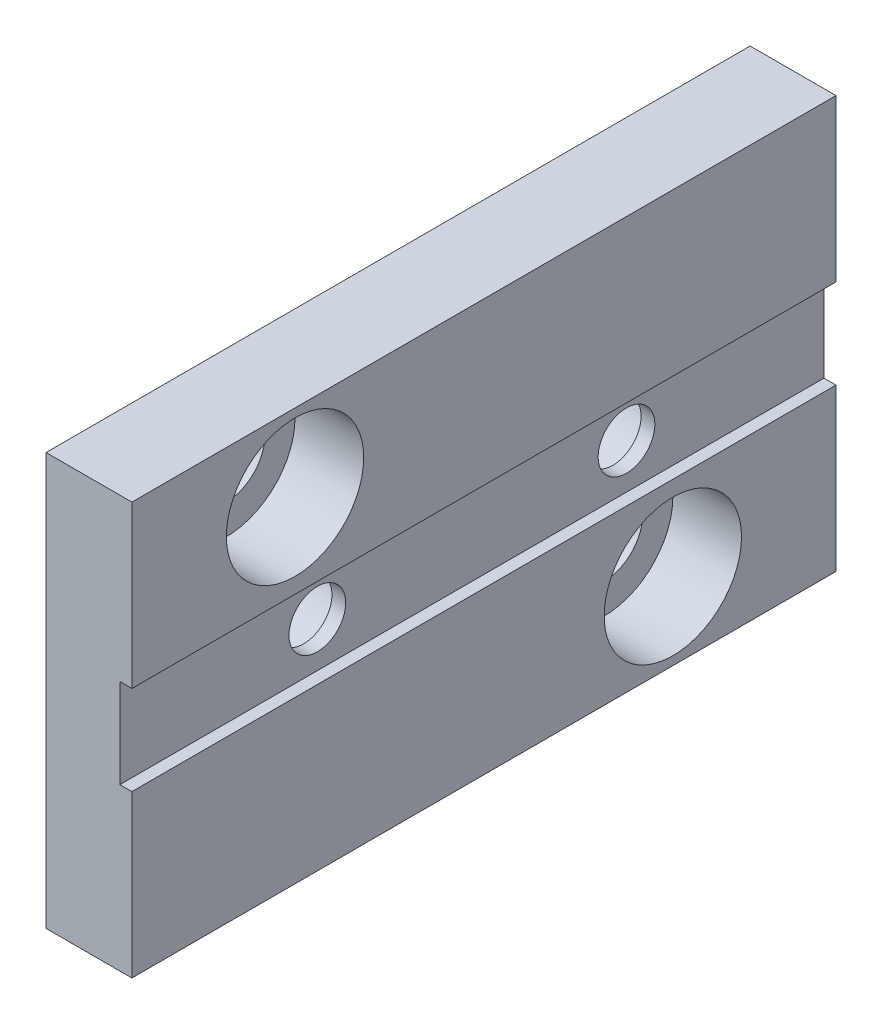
ISO-10303-21;
HEADER;
FILE_DESCRIPTION(('STEP AP214'),'2;1');
FILE_NAME('part.step','',(''),(''),'','','');
FILE_SCHEMA(('AUTOMOTIVE_DESIGN { 1 0 10303 214 1 1 1 1 }'));
ENDSEC;
DATA;
#1=APPLICATION_CONTEXT('core data for automotive mechanical design processes');
#2=APPLICATION_PROTOCOL_DEFINITION('international standard','automotive_design',2000,#1);
#3=PRODUCT_CONTEXT('',#1,'mechanical');
#4=PRODUCT('Part','Part','',(#3));
#5=PRODUCT_RELATED_PRODUCT_CATEGORY('part','',(#4));
#6=PRODUCT_DEFINITION_FORMATION('','',#4);
#7=PRODUCT_DEFINITION_CONTEXT('part definition',#1,'design');
#8=PRODUCT_DEFINITION('design','',#6,#7);
#9=PRODUCT_DEFINITION_SHAPE('','',#8);
#10=(LENGTH_UNIT() NAMED_UNIT(*) SI_UNIT(.MILLI.,.METRE.));
#11=(NAMED_UNIT(*) PLANE_ANGLE_UNIT() SI_UNIT($,.RADIAN.));
#12=(NAMED_UNIT(*) SI_UNIT($,.STERADIAN.) SOLID_ANGLE_UNIT());
#13=UNCERTAINTY_MEASURE_WITH_UNIT(LENGTH_MEASURE(1.E-05),#10,'distance_accuracy_value','');
#14=(GEOMETRIC_REPRESENTATION_CONTEXT(3) GLOBAL_UNCERTAINTY_ASSIGNED_CONTEXT((#13)) GLOBAL_UNIT_ASSIGNED_CONTEXT((#10,
#11,#12)) REPRESENTATION_CONTEXT('',''));
#15=CARTESIAN_POINT('',(0.,0.,0.));
#16=DIRECTION('',(0.,0.,1.));
#17=DIRECTION('',(1.,0.,0.));
#18=AXIS2_PLACEMENT_3D('',#15,#16,#17);
#19=CARTESIAN_POINT('',(1.,0.5,-11.));
#20=DIRECTION('',(1.,0.,0.));
#21=DIRECTION('',(0.,0.,-1.));
#22=AXIS2_PLACEMENT_3D('',#19,#20,#21);
#23=CYLINDRICAL_SURFACE('',#22,4.);
#24=CARTESIAN_POINT('',(5.,0.5,-11.));
#25=DIRECTION('',(1.,0.,0.));
#26=DIRECTION('',(0.,0.,-1.));
#27=AXIS2_PLACEMENT_3D('',#24,#25,#26);
#28=CIRCLE('',#27,4.);
#29=CARTESIAN_POINT('',(5.,0.5,-15.));
#30=VERTEX_POINT('',#29);
#31=EDGE_CURVE('E126',#30,#30,#28,.F.);
#32=ORIENTED_EDGE('',*,*,#31,.F.);
#33=EDGE_LOOP('',(#32));
#34=FACE_BOUND('',#33,.T.);
#35=CARTESIAN_POINT('',(1.,0.5,-11.));
#36=DIRECTION('',(1.,0.,0.));
#37=DIRECTION('',(0.,0.,-1.));
#38=AXIS2_PLACEMENT_3D('',#35,#36,#37);
#39=CIRCLE('',#38,4.);
#40=CARTESIAN_POINT('',(1.,0.5,-15.));
#41=VERTEX_POINT('',#40);
#42=EDGE_CURVE('E20',#41,#41,#39,.T.);
#43=ORIENTED_EDGE('',*,*,#42,.F.);
#44=EDGE_LOOP('',(#43));
#45=FACE_BOUND('',#44,.T.);
#46=ADVANCED_FACE('F17',(#34,#45),#23,.F.);
#47=CARTESIAN_POINT('',(4.3,8.,9.));
#48=DIRECTION('',(-1.,0.,0.));
#49=DIRECTION('',(0.,0.,1.));
#50=AXIS2_PLACEMENT_3D('',#47,#48,#49);
#51=CYLINDRICAL_SURFACE('',#50,1.65);
#52=CARTESIAN_POINT('',(4.3,8.,9.));
#53=DIRECTION('',(-1.,0.,0.));
#54=DIRECTION('',(0.,0.,1.));
#55=AXIS2_PLACEMENT_3D('',#52,#53,#54);
#56=CIRCLE('',#55,1.65);
#57=CARTESIAN_POINT('',(4.3,8.,10.65));
#58=VERTEX_POINT('',#57);
#59=EDGE_CURVE('E122',#58,#58,#56,.F.);
#60=ORIENTED_EDGE('',*,*,#59,.T.);
#61=EDGE_LOOP('',(#60));
#62=FACE_BOUND('',#61,.T.);
#63=CARTESIAN_POINT('',(3.5,8.,9.));
#64=DIRECTION('',(-1.,0.,0.));
#65=DIRECTION('',(0.,0.,1.));
#66=AXIS2_PLACEMENT_3D('',#63,#64,#65);
#67=CIRCLE('',#66,1.65);
#68=CARTESIAN_POINT('',(3.5,8.,10.65));
#69=VERTEX_POINT('',#68);
#70=EDGE_CURVE('E159',#69,#69,#67,.F.);
#71=ORIENTED_EDGE('',*,*,#70,.F.);
#72=EDGE_LOOP('',(#71));
#73=FACE_BOUND('',#72,.T.);
#74=ADVANCED_FACE('F174',(#62,#73),#51,.F.);
#75=CARTESIAN_POINT('',(4.3,5.4,-42.));
#76=DIRECTION('',(0.,-1.,0.));
#77=DIRECTION('',(0.,0.,-1.));
#78=AXIS2_PLACEMENT_3D('',#75,#76,#77);
#79=PLANE('',#78);
#80=DIRECTION('',(1.,0.,0.));
#81=VECTOR('',#80,1.);
#82=CARTESIAN_POINT('',(4.3,5.4,-20.5));
#83=LINE('',#82,#81);
#84=CARTESIAN_POINT('',(4.3,5.4,-20.5));
#85=VERTEX_POINT('',#84);
#86=CARTESIAN_POINT('',(5.,5.4,-20.5));
#87=VERTEX_POINT('',#86);
#88=EDGE_CURVE('E92',#85,#87,#83,.T.);
#89=ORIENTED_EDGE('',*,*,#88,.F.);
#90=DIRECTION('',(0.,0.,1.));
#91=VECTOR('',#90,1.);
#92=CARTESIAN_POINT('',(4.3,5.4,-42.));
#93=LINE('',#92,#91);
#94=CARTESIAN_POINT('',(4.3,5.4,20.5));
#95=VERTEX_POINT('',#94);
#96=EDGE_CURVE('E116',#85,#95,#93,.T.);
#97=ORIENTED_EDGE('',*,*,#96,.T.);
#98=DIRECTION('',(1.,0.,0.));
#99=VECTOR('',#98,1.);
#100=CARTESIAN_POINT('',(4.3,5.4,20.5));
#101=LINE('',#100,#99);
#102=CARTESIAN_POINT('',(5.,5.4,20.5));
#103=VERTEX_POINT('',#102);
#104=EDGE_CURVE('E129',#103,#95,#101,.F.);
#105=ORIENTED_EDGE('',*,*,#104,.F.);
#106=DIRECTION('',(0.,0.,-1.));
#107=VECTOR('',#106,1.);
#108=CARTESIAN_POINT('',(5.,5.4,0.));
#109=LINE('',#108,#107);
#110=EDGE_CURVE('E123',#87,#103,#109,.F.);
#111=ORIENTED_EDGE('',*,*,#110,.F.);
#112=EDGE_LOOP('',(#89,#97,#105,#111));
#113=FACE_BOUND('',#112,.T.);
#114=ADVANCED_FACE('F180',(#113),#79,.F.);
#115=CARTESIAN_POINT('',(4.3,8.,-9.));
#116=DIRECTION('',(-1.,0.,0.));
#117=DIRECTION('',(0.,0.,1.));
#118=AXIS2_PLACEMENT_3D('',#115,#116,#117);
#119=CYLINDRICAL_SURFACE('',#118,1.65);
#120=CARTESIAN_POINT('',(4.3,8.,-9.));
#121=DIRECTION('',(-1.,0.,0.));
#122=DIRECTION('',(0.,0.,1.));
#123=AXIS2_PLACEMENT_3D('',#120,#121,#122);
#124=CIRCLE('',#123,1.65);
#125=CARTESIAN_POINT('',(4.3,8.,-7.35));
#126=VERTEX_POINT('',#125);
#127=EDGE_CURVE('E119',#126,#126,#124,.F.);
#128=ORIENTED_EDGE('',*,*,#127,.T.);
#129=EDGE_LOOP('',(#128));
#130=FACE_BOUND('',#129,.T.);
#131=CARTESIAN_POINT('',(3.5,8.,-9.));
#132=DIRECTION('',(-1.,0.,0.));
#133=DIRECTION('',(0.,0.,1.));
#134=AXIS2_PLACEMENT_3D('',#131,#132,#133);
#135=CIRCLE('',#134,1.65);
#136=CARTESIAN_POINT('',(3.5,8.,-7.35));
#137=VERTEX_POINT('',#136);
#138=EDGE_CURVE('E162',#137,#137,#135,.F.);
#139=ORIENTED_EDGE('',*,*,#138,.F.);
#140=EDGE_LOOP('',(#139));
#141=FACE_BOUND('',#140,.T.);
#142=ADVANCED_FACE('F251',(#130,#141),#119,.F.);
#143=CARTESIAN_POINT('',(1.,15.5,11.));
#144=DIRECTION('',(1.,0.,0.));
#145=DIRECTION('',(0.,0.,-1.));
#146=AXIS2_PLACEMENT_3D('',#143,#144,#145);
#147=CYLINDRICAL_SURFACE('',#146,4.);
#148=CARTESIAN_POINT('',(5.,15.5,11.));
#149=DIRECTION('',(1.,0.,0.));
#150=DIRECTION('',(0.,0.,-1.));
#151=AXIS2_PLACEMENT_3D('',#148,#149,#150);
#152=CIRCLE('',#151,4.);
#153=CARTESIAN_POINT('',(5.,15.5,7.));
#154=VERTEX_POINT('',#153);
#155=EDGE_CURVE('E101',#154,#154,#152,.F.);
#156=ORIENTED_EDGE('',*,*,#155,.F.);
#157=EDGE_LOOP('',(#156));
#158=FACE_BOUND('',#157,.T.);
#159=CARTESIAN_POINT('',(1.,15.5,11.));
#160=DIRECTION('',(1.,0.,0.));
#161=DIRECTION('',(0.,0.,-1.));
#162=AXIS2_PLACEMENT_3D('',#159,#160,#161);
#163=CIRCLE('',#162,4.);
#164=CARTESIAN_POINT('',(1.,15.5,7.));
#165=VERTEX_POINT('',#164);
#166=EDGE_CURVE('E164',#165,#165,#163,.T.);
#167=ORIENTED_EDGE('',*,*,#166,.F.);
#168=EDGE_LOOP('',(#167));
#169=FACE_BOUND('',#168,.T.);
#170=ADVANCED_FACE('F248',(#158,#169),#147,.F.);
#171=CARTESIAN_POINT('',(14.7,10.6,-42.));
#172=DIRECTION('',(0.,1.,0.));
#173=DIRECTION('',(0.,0.,1.));
#174=AXIS2_PLACEMENT_3D('',#171,#172,#173);
#175=PLANE('',#174);
#176=DIRECTION('',(1.,0.,0.));
#177=VECTOR('',#176,1.);
#178=CARTESIAN_POINT('',(14.7,10.6,-20.5));
#179=LINE('',#178,#177);
#180=CARTESIAN_POINT('',(5.,10.6,-20.5));
#181=VERTEX_POINT('',#180);
#182=CARTESIAN_POINT('',(4.3,10.6,-20.5));
#183=VERTEX_POINT('',#182);
#184=EDGE_CURVE('E91',#181,#183,#179,.F.);
#185=ORIENTED_EDGE('',*,*,#184,.F.);
#186=DIRECTION('',(0.,0.,-1.));
#187=VECTOR('',#186,1.);
#188=CARTESIAN_POINT('',(5.,10.6,0.));
#189=LINE('',#188,#187);
#190=CARTESIAN_POINT('',(5.,10.6,20.5));
#191=VERTEX_POINT('',#190);
#192=EDGE_CURVE('E95',#191,#181,#189,.T.);
#193=ORIENTED_EDGE('',*,*,#192,.F.);
#194=DIRECTION('',(1.,0.,0.));
#195=VECTOR('',#194,1.);
#196=CARTESIAN_POINT('',(14.7,10.6,20.5));
#197=LINE('',#196,#195);
#198=CARTESIAN_POINT('',(4.3,10.6,20.5));
#199=VERTEX_POINT('',#198);
#200=EDGE_CURVE('E79',#199,#191,#197,.T.);
#201=ORIENTED_EDGE('',*,*,#200,.F.);
#202=DIRECTION('',(0.,0.,1.));
#203=VECTOR('',#202,1.);
#204=CARTESIAN_POINT('',(4.3,10.6,-42.));
#205=LINE('',#204,#203);
#206=EDGE_CURVE('E120',#199,#183,#205,.F.);
#207=ORIENTED_EDGE('',*,*,#206,.T.);
#208=EDGE_LOOP('',(#185,#193,#201,#207));
#209=FACE_BOUND('',#208,.T.);
#210=ADVANCED_FACE('F96',(#209),#175,.F.);
#211=CARTESIAN_POINT('',(1.,0.5,-11.));
#212=DIRECTION('',(1.,0.,0.));
#213=DIRECTION('',(0.,0.,-1.));
#214=AXIS2_PLACEMENT_3D('',#211,#212,#213);
#215=PLANE('',#214);
#216=CARTESIAN_POINT('',(1.,0.5,-11.));
#217=DIRECTION('',(1.,0.,0.));
#218=DIRECTION('',(0.,0.,-1.));
#219=AXIS2_PLACEMENT_3D('',#216,#217,#218);
#220=CIRCLE('',#219,2.25);
#221=CARTESIAN_POINT('',(1.,0.5,-13.25));
#222=VERTEX_POINT('',#221);
#223=EDGE_CURVE('E100',#222,#222,#220,.F.);
#224=ORIENTED_EDGE('',*,*,#223,.T.);
#225=EDGE_LOOP('',(#224));
#226=FACE_BOUND('',#225,.T.);
#227=ORIENTED_EDGE('',*,*,#42,.T.);
#228=EDGE_LOOP('',(#227));
#229=FACE_BOUND('',#228,.T.);
#230=ADVANCED_FACE('F171',(#226,#229),#215,.T.);
#231=CARTESIAN_POINT('',(1.,15.5,11.));
#232=DIRECTION('',(1.,0.,0.));
#233=DIRECTION('',(0.,0.,-1.));
#234=AXIS2_PLACEMENT_3D('',#231,#232,#233);
#235=PLANE('',#234);
#236=CARTESIAN_POINT('',(1.,15.5,11.));
#237=DIRECTION('',(1.,0.,0.));
#238=DIRECTION('',(0.,0.,-1.));
#239=AXIS2_PLACEMENT_3D('',#236,#237,#238);
#240=CIRCLE('',#239,2.25);
#241=CARTESIAN_POINT('',(1.,15.5,8.75));
#242=VERTEX_POINT('',#241);
#243=EDGE_CURVE('E146',#242,#242,#240,.F.);
#244=ORIENTED_EDGE('',*,*,#243,.T.);
#245=EDGE_LOOP('',(#244));
#246=FACE_BOUND('',#245,.T.);
#247=ORIENTED_EDGE('',*,*,#166,.T.);
#248=EDGE_LOOP('',(#247));
#249=FACE_BOUND('',#248,.T.);
#250=ADVANCED_FACE('F238',(#246,#249),#235,.T.);
#251=CARTESIAN_POINT('',(3.5,11.1,-9.));
#252=DIRECTION('',(-1.,0.,0.));
#253=DIRECTION('',(0.,0.,1.));
#254=AXIS2_PLACEMENT_3D('',#251,#252,#253);
#255=PLANE('',#254);
#256=ORIENTED_EDGE('',*,*,#138,.T.);
#257=EDGE_LOOP('',(#256));
#258=FACE_BOUND('',#257,.T.);
#259=CARTESIAN_POINT('',(3.5,8.,-9.));
#260=DIRECTION('',(-1.,0.,0.));
#261=DIRECTION('',(0.,0.,1.));
#262=AXIS2_PLACEMENT_3D('',#259,#260,#261);
#263=CIRCLE('',#262,3.1);
#264=CARTESIAN_POINT('',(3.5,8.,-5.9));
#265=VERTEX_POINT('',#264);
#266=EDGE_CURVE('E112',#265,#265,#263,.T.);
#267=ORIENTED_EDGE('',*,*,#266,.T.);
#268=EDGE_LOOP('',(#267));
#269=FACE_BOUND('',#268,.T.);
#270=ADVANCED_FACE('F234',(#258,#269),#255,.T.);
#271=CARTESIAN_POINT('',(3.5,11.1,9.));
#272=DIRECTION('',(-1.,0.,0.));
#273=DIRECTION('',(0.,0.,1.));
#274=AXIS2_PLACEMENT_3D('',#271,#272,#273);
#275=PLANE('',#274);
#276=ORIENTED_EDGE('',*,*,#70,.T.);
#277=EDGE_LOOP('',(#276));
#278=FACE_BOUND('',#277,.T.);
#279=CARTESIAN_POINT('',(3.5,8.,9.));
#280=DIRECTION('',(-1.,0.,0.));
#281=DIRECTION('',(0.,0.,1.));
#282=AXIS2_PLACEMENT_3D('',#279,#280,#281);
#283=CIRCLE('',#282,3.1);
#284=CARTESIAN_POINT('',(3.5,8.,12.1));
#285=VERTEX_POINT('',#284);
#286=EDGE_CURVE('E107',#285,#285,#283,.T.);
#287=ORIENTED_EDGE('',*,*,#286,.T.);
#288=EDGE_LOOP('',(#287));
#289=FACE_BOUND('',#288,.T.);
#290=ADVANCED_FACE('F230',(#278,#289),#275,.T.);
#291=CARTESIAN_POINT('',(5.,0.,0.));
#292=DIRECTION('',(1.,0.,0.));
#293=DIRECTION('',(0.,0.,-1.));
#294=AXIS2_PLACEMENT_3D('',#291,#292,#293);
#295=PLANE('',#294);
#296=DIRECTION('',(0.,0.,-1.));
#297=VECTOR('',#296,1.);
#298=CARTESIAN_POINT('',(5.,-4.,20.5));
#299=LINE('',#298,#297);
#300=CARTESIAN_POINT('',(5.,-4.,-20.5));
#301=VERTEX_POINT('',#300);
#302=CARTESIAN_POINT('',(5.,-4.,20.5));
#303=VERTEX_POINT('',#302);
#304=EDGE_CURVE('E283',#301,#303,#299,.F.);
#305=ORIENTED_EDGE('',*,*,#304,.F.);
#306=DIRECTION('',(0.,-1.,0.));
#307=VECTOR('',#306,1.);
#308=CARTESIAN_POINT('',(5.,0.2,-20.5));
#309=LINE('',#308,#307);
#310=EDGE_CURVE('E270',#301,#87,#309,.F.);
#311=ORIENTED_EDGE('',*,*,#310,.T.);
#312=ORIENTED_EDGE('',*,*,#110,.T.);
#313=DIRECTION('',(0.,1.,0.));
#314=VECTOR('',#313,1.);
#315=CARTESIAN_POINT('',(5.,15.8,20.5));
#316=LINE('',#315,#314);
#317=EDGE_CURVE('E109',#103,#303,#316,.F.);
#318=ORIENTED_EDGE('',*,*,#317,.T.);
#319=EDGE_LOOP('',(#305,#311,#312,#318));
#320=FACE_BOUND('',#319,.T.);
#321=ORIENTED_EDGE('',*,*,#31,.T.);
#322=EDGE_LOOP('',(#321));
#323=FACE_BOUND('',#322,.T.);
#324=ADVANCED_FACE('F226',(#320,#323),#295,.T.);
#325=CARTESIAN_POINT('',(4.3,10.6,-42.));
#326=DIRECTION('',(-1.,0.,0.));
#327=DIRECTION('',(0.,-1.,0.));
#328=AXIS2_PLACEMENT_3D('',#325,#326,#327);
#329=PLANE('',#328);
#330=ORIENTED_EDGE('',*,*,#127,.F.);
#331=EDGE_LOOP('',(#330));
#332=FACE_BOUND('',#331,.T.);
#333=DIRECTION('',(0.,-1.,0.));
#334=VECTOR('',#333,1.);
#335=CARTESIAN_POINT('',(4.3,0.2,-20.5));
#336=LINE('',#335,#334);
#337=EDGE_CURVE('E268',#85,#183,#336,.F.);
#338=ORIENTED_EDGE('',*,*,#337,.T.);
#339=ORIENTED_EDGE('',*,*,#206,.F.);
#340=DIRECTION('',(0.,1.,0.));
#341=VECTOR('',#340,1.);
#342=CARTESIAN_POINT('',(4.3,15.8,20.5));
#343=LINE('',#342,#341);
#344=EDGE_CURVE('E90',#199,#95,#343,.F.);
#345=ORIENTED_EDGE('',*,*,#344,.T.);
#346=ORIENTED_EDGE('',*,*,#96,.F.);
#347=EDGE_LOOP('',(#338,#339,#345,#346));
#348=FACE_BOUND('',#347,.T.);
#349=ORIENTED_EDGE('',*,*,#59,.F.);
#350=EDGE_LOOP('',(#349));
#351=FACE_BOUND('',#350,.T.);
#352=ADVANCED_FACE('F223',(#332,#348,#351),#329,.F.);
#353=CARTESIAN_POINT('',(5.,0.,0.));
#354=DIRECTION('',(1.,0.,0.));
#355=DIRECTION('',(0.,0.,-1.));
#356=AXIS2_PLACEMENT_3D('',#353,#354,#355);
#357=PLANE('',#356);
#358=ORIENTED_EDGE('',*,*,#192,.T.);
#359=DIRECTION('',(0.,-1.,0.));
#360=VECTOR('',#359,1.);
#361=CARTESIAN_POINT('',(5.,0.2,-20.5));
#362=LINE('',#361,#360);
#363=CARTESIAN_POINT('',(5.,20.,-20.5));
#364=VERTEX_POINT('',#363);
#365=EDGE_CURVE('E279',#181,#364,#362,.F.);
#366=ORIENTED_EDGE('',*,*,#365,.T.);
#367=DIRECTION('',(0.,0.,1.));
#368=VECTOR('',#367,1.);
#369=CARTESIAN_POINT('',(5.,20.,20.5));
#370=LINE('',#369,#368);
#371=CARTESIAN_POINT('',(5.,20.,20.5));
#372=VERTEX_POINT('',#371);
#373=EDGE_CURVE('E106',#372,#364,#370,.F.);
#374=ORIENTED_EDGE('',*,*,#373,.F.);
#375=DIRECTION('',(0.,1.,0.));
#376=VECTOR('',#375,1.);
#377=CARTESIAN_POINT('',(5.,15.8,20.5));
#378=LINE('',#377,#376);
#379=EDGE_CURVE('E87',#372,#191,#378,.F.);
#380=ORIENTED_EDGE('',*,*,#379,.T.);
#381=EDGE_LOOP('',(#358,#366,#374,#380));
#382=FACE_BOUND('',#381,.T.);
#383=ORIENTED_EDGE('',*,*,#155,.T.);
#384=EDGE_LOOP('',(#383));
#385=FACE_BOUND('',#384,.T.);
#386=ADVANCED_FACE('F104',(#382,#385),#357,.T.);
#387=CARTESIAN_POINT('',(0.,0.5,-11.));
#388=DIRECTION('',(1.,0.,0.));
#389=DIRECTION('',(0.,0.,-1.));
#390=AXIS2_PLACEMENT_3D('',#387,#388,#389);
#391=CYLINDRICAL_SURFACE('',#390,2.25);
#392=CARTESIAN_POINT('',(0.,0.5,-11.));
#393=DIRECTION('',(1.,0.,0.));
#394=DIRECTION('',(0.,0.,-1.));
#395=AXIS2_PLACEMENT_3D('',#392,#393,#394);
#396=CIRCLE('',#395,2.25);
#397=CARTESIAN_POINT('',(0.,0.5,-13.25));
#398=VERTEX_POINT('',#397);
#399=EDGE_CURVE('E141',#398,#398,#396,.F.);
#400=ORIENTED_EDGE('',*,*,#399,.T.);
#401=EDGE_LOOP('',(#400));
#402=FACE_BOUND('',#401,.T.);
#403=ORIENTED_EDGE('',*,*,#223,.F.);
#404=EDGE_LOOP('',(#403));
#405=FACE_BOUND('',#404,.T.);
#406=ADVANCED_FACE('F216',(#402,#405),#391,.F.);
#407=CARTESIAN_POINT('',(0.,15.5,11.));
#408=DIRECTION('',(1.,0.,0.));
#409=DIRECTION('',(0.,0.,-1.));
#410=AXIS2_PLACEMENT_3D('',#407,#408,#409);
#411=CYLINDRICAL_SURFACE('',#410,2.25);
#412=CARTESIAN_POINT('',(0.,15.5,11.));
#413=DIRECTION('',(1.,0.,0.));
#414=DIRECTION('',(0.,0.,-1.));
#415=AXIS2_PLACEMENT_3D('',#412,#413,#414);
#416=CIRCLE('',#415,2.25);
#417=CARTESIAN_POINT('',(0.,15.5,8.75));
#418=VERTEX_POINT('',#417);
#419=EDGE_CURVE('E138',#418,#418,#416,.F.);
#420=ORIENTED_EDGE('',*,*,#419,.T.);
#421=EDGE_LOOP('',(#420));
#422=FACE_BOUND('',#421,.T.);
#423=ORIENTED_EDGE('',*,*,#243,.F.);
#424=EDGE_LOOP('',(#423));
#425=FACE_BOUND('',#424,.T.);
#426=ADVANCED_FACE('F212',(#422,#425),#411,.F.);
#427=CARTESIAN_POINT('',(4.3,8.,-9.));
#428=DIRECTION('',(-1.,0.,0.));
#429=DIRECTION('',(0.,0.,1.));
#430=AXIS2_PLACEMENT_3D('',#427,#428,#429);
#431=CYLINDRICAL_SURFACE('',#430,3.1);
#432=ORIENTED_EDGE('',*,*,#266,.F.);
#433=EDGE_LOOP('',(#432));
#434=FACE_BOUND('',#433,.T.);
#435=CARTESIAN_POINT('',(0.,8.,-9.));
#436=DIRECTION('',(-1.,0.,0.));
#437=DIRECTION('',(0.,0.,1.));
#438=AXIS2_PLACEMENT_3D('',#435,#436,#437);
#439=CIRCLE('',#438,3.1);
#440=CARTESIAN_POINT('',(0.,8.,-5.9));
#441=VERTEX_POINT('',#440);
#442=EDGE_CURVE('E135',#441,#441,#439,.T.);
#443=ORIENTED_EDGE('',*,*,#442,.T.);
#444=EDGE_LOOP('',(#443));
#445=FACE_BOUND('',#444,.T.);
#446=ADVANCED_FACE('F208',(#434,#445),#431,.F.);
#447=CARTESIAN_POINT('',(4.3,8.,9.));
#448=DIRECTION('',(-1.,0.,0.));
#449=DIRECTION('',(0.,0.,1.));
#450=AXIS2_PLACEMENT_3D('',#447,#448,#449);
#451=CYLINDRICAL_SURFACE('',#450,3.1);
#452=ORIENTED_EDGE('',*,*,#286,.F.);
#453=EDGE_LOOP('',(#452));
#454=FACE_BOUND('',#453,.T.);
#455=CARTESIAN_POINT('',(0.,8.,9.));
#456=DIRECTION('',(-1.,0.,0.));
#457=DIRECTION('',(0.,0.,1.));
#458=AXIS2_PLACEMENT_3D('',#455,#456,#457);
#459=CIRCLE('',#458,3.1);
#460=CARTESIAN_POINT('',(0.,8.,12.1));
#461=VERTEX_POINT('',#460);
#462=EDGE_CURVE('E131',#461,#461,#459,.T.);
#463=ORIENTED_EDGE('',*,*,#462,.T.);
#464=EDGE_LOOP('',(#463));
#465=FACE_BOUND('',#464,.T.);
#466=ADVANCED_FACE('F205',(#454,#465),#451,.F.);
#467=CARTESIAN_POINT('',(5.,15.8,20.5));
#468=DIRECTION('',(0.,0.,-1.));
#469=DIRECTION('',(-1.,0.,0.));
#470=AXIS2_PLACEMENT_3D('',#467,#468,#469);
#471=PLANE('',#470);
#472=DIRECTION('',(1.,0.,0.));
#473=VECTOR('',#472,1.);
#474=CARTESIAN_POINT('',(-42.0637611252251,-4.,20.5));
#475=LINE('',#474,#473);
#476=CARTESIAN_POINT('',(0.,-4.,20.5));
#477=VERTEX_POINT('',#476);
#478=EDGE_CURVE('E281',#303,#477,#475,.F.);
#479=ORIENTED_EDGE('',*,*,#478,.F.);
#480=ORIENTED_EDGE('',*,*,#317,.F.);
#481=ORIENTED_EDGE('',*,*,#104,.T.);
#482=ORIENTED_EDGE('',*,*,#344,.F.);
#483=ORIENTED_EDGE('',*,*,#200,.T.);
#484=ORIENTED_EDGE('',*,*,#379,.F.);
#485=DIRECTION('',(1.,0.,0.));
#486=VECTOR('',#485,1.);
#487=CARTESIAN_POINT('',(-42.0637611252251,20.,20.5));
#488=LINE('',#487,#486);
#489=CARTESIAN_POINT('',(0.,20.,20.5));
#490=VERTEX_POINT('',#489);
#491=EDGE_CURVE('E269',#490,#372,#488,.T.);
#492=ORIENTED_EDGE('',*,*,#491,.F.);
#493=DIRECTION('',(0.,1.,0.));
#494=VECTOR('',#493,1.);
#495=CARTESIAN_POINT('',(0.,0.,20.5));
#496=LINE('',#495,#494);
#497=EDGE_CURVE('E134',#490,#477,#496,.F.);
#498=ORIENTED_EDGE('',*,*,#497,.T.);
#499=EDGE_LOOP('',(#479,#480,#481,#482,#483,#484,#492,#498));
#500=FACE_BOUND('',#499,.T.);
#501=ADVANCED_FACE('F84',(#500),#471,.F.);
#502=CARTESIAN_POINT('',(-42.0637611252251,-4.,20.5));
#503=DIRECTION('',(0.,-1.,0.));
#504=DIRECTION('',(0.,0.,-1.));
#505=AXIS2_PLACEMENT_3D('',#502,#503,#504);
#506=PLANE('',#505);
#507=ORIENTED_EDGE('',*,*,#304,.T.);
#508=ORIENTED_EDGE('',*,*,#478,.T.);
#509=DIRECTION('',(0.,0.,-1.));
#510=VECTOR('',#509,1.);
#511=CARTESIAN_POINT('',(0.,-4.,0.));
#512=LINE('',#511,#510);
#513=CARTESIAN_POINT('',(0.,-4.,-20.5));
#514=VERTEX_POINT('',#513);
#515=EDGE_CURVE('E290',#477,#514,#512,.T.);
#516=ORIENTED_EDGE('',*,*,#515,.T.);
#517=DIRECTION('',(1.,0.,0.));
#518=VECTOR('',#517,1.);
#519=CARTESIAN_POINT('',(5.,-4.,-20.5));
#520=LINE('',#519,#518);
#521=EDGE_CURVE('E273',#514,#301,#520,.T.);
#522=ORIENTED_EDGE('',*,*,#521,.T.);
#523=EDGE_LOOP('',(#507,#508,#516,#522));
#524=FACE_BOUND('',#523,.T.);
#525=ADVANCED_FACE('F198',(#524),#506,.T.);
#526=CARTESIAN_POINT('',(5.,0.2,-20.5));
#527=DIRECTION('',(0.,0.,1.));
#528=DIRECTION('',(0.,-1.,0.));
#529=AXIS2_PLACEMENT_3D('',#526,#527,#528);
#530=PLANE('',#529);
#531=ORIENTED_EDGE('',*,*,#88,.T.);
#532=ORIENTED_EDGE('',*,*,#310,.F.);
#533=ORIENTED_EDGE('',*,*,#521,.F.);
#534=DIRECTION('',(0.,1.,0.));
#535=VECTOR('',#534,1.);
#536=CARTESIAN_POINT('',(0.,0.,-20.5));
#537=LINE('',#536,#535);
#538=CARTESIAN_POINT('',(0.,20.,-20.5));
#539=VERTEX_POINT('',#538);
#540=EDGE_CURVE('E26',#514,#539,#537,.T.);
#541=ORIENTED_EDGE('',*,*,#540,.T.);
#542=DIRECTION('',(1.,0.,0.));
#543=VECTOR('',#542,1.);
#544=CARTESIAN_POINT('',(-42.0637611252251,20.,-20.5));
#545=LINE('',#544,#543);
#546=EDGE_CURVE('E34',#364,#539,#545,.F.);
#547=ORIENTED_EDGE('',*,*,#546,.F.);
#548=ORIENTED_EDGE('',*,*,#365,.F.);
#549=ORIENTED_EDGE('',*,*,#184,.T.);
#550=ORIENTED_EDGE('',*,*,#337,.F.);
#551=EDGE_LOOP('',(#531,#532,#533,#541,#547,#548,#549,#550));
#552=FACE_BOUND('',#551,.T.);
#553=ADVANCED_FACE('F191',(#552),#530,.F.);
#554=CARTESIAN_POINT('',(-42.0637611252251,20.,20.5));
#555=DIRECTION('',(0.,1.,0.));
#556=DIRECTION('',(0.,0.,1.));
#557=AXIS2_PLACEMENT_3D('',#554,#555,#556);
#558=PLANE('',#557);
#559=ORIENTED_EDGE('',*,*,#373,.T.);
#560=ORIENTED_EDGE('',*,*,#546,.T.);
#561=DIRECTION('',(0.,0.,-1.));
#562=VECTOR('',#561,1.);
#563=CARTESIAN_POINT('',(0.,20.,0.));
#564=LINE('',#563,#562);
#565=EDGE_CURVE('E11',#539,#490,#564,.F.);
#566=ORIENTED_EDGE('',*,*,#565,.T.);
#567=ORIENTED_EDGE('',*,*,#491,.T.);
#568=EDGE_LOOP('',(#559,#560,#566,#567));
#569=FACE_BOUND('',#568,.T.);
#570=ADVANCED_FACE('F185',(#569),#558,.T.);
#571=CARTESIAN_POINT('',(0.,0.,0.));
#572=DIRECTION('',(1.,0.,0.));
#573=DIRECTION('',(0.,0.,-1.));
#574=AXIS2_PLACEMENT_3D('',#571,#572,#573);
#575=PLANE('',#574);
#576=ORIENTED_EDGE('',*,*,#540,.F.);
#577=ORIENTED_EDGE('',*,*,#515,.F.);
#578=ORIENTED_EDGE('',*,*,#497,.F.);
#579=ORIENTED_EDGE('',*,*,#565,.F.);
#580=EDGE_LOOP('',(#576,#577,#578,#579));
#581=FACE_BOUND('',#580,.T.);
#582=ORIENTED_EDGE('',*,*,#462,.F.);
#583=EDGE_LOOP('',(#582));
#584=FACE_BOUND('',#583,.T.);
#585=ORIENTED_EDGE('',*,*,#442,.F.);
#586=EDGE_LOOP('',(#585));
#587=FACE_BOUND('',#586,.T.);
#588=ORIENTED_EDGE('',*,*,#419,.F.);
#589=EDGE_LOOP('',(#588));
#590=FACE_BOUND('',#589,.T.);
#591=ORIENTED_EDGE('',*,*,#399,.F.);
#592=EDGE_LOOP('',(#591));
#593=FACE_BOUND('',#592,.T.);
#594=ADVANCED_FACE('F183',(#581,#584,#587,#590,#593),#575,.F.);
#595=CLOSED_SHELL('',(#46,#74,#114,#142,#170,#210,#230,#250,#270,#290,#324,#352,#386,#406,#426,
#446,#466,#501,#525,#553,#570,#594));
#596=MANIFOLD_SOLID_BREP('B1',#595);
#597=ADVANCED_BREP_SHAPE_REPRESENTATION('',(#18,#596),#14);
#598=SHAPE_DEFINITION_REPRESENTATION(#9,#597);
ENDSEC;
END-ISO-10303-21;
